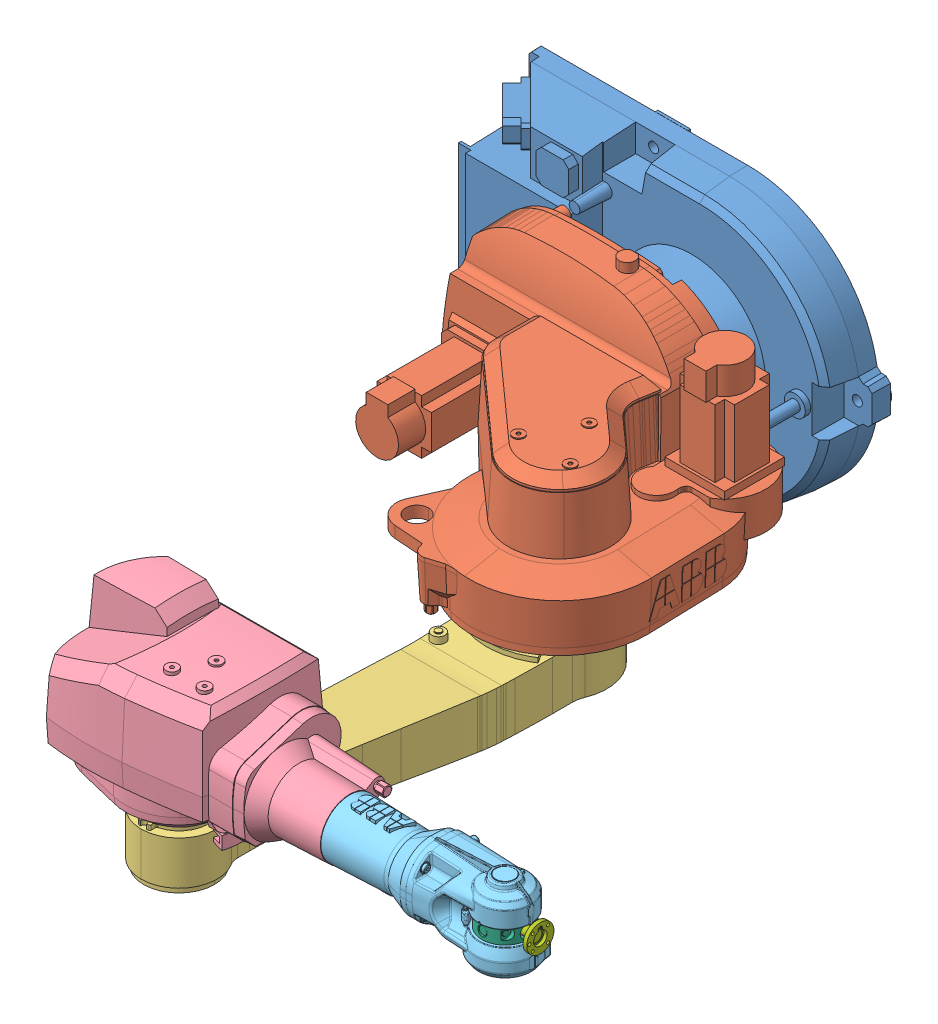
SolidWorks assembly IRB1600_X-145.SLDASM, configuration Default (file format 13000). Lengths in mm.
Overall size (1197.36 510.23 1294.47).
7 component instances, 7 part files, 0 mates.
Components (placement in the parent):
- IRB1600_X-145_IRC5_rev2_BASE-1: IRB1600_X-145_IRC5_rev2_BASE.SLDPRT [Default] at origin size (660.28 510.23 171)
- IRB1600_X-145_IRC5_rev2_LINK1-1: IRB1600_X-145_IRC5_rev2_LINK1.SLDPRT [Default] at origin size (601.3 362.57 535.06)
- IRB1600_X-145_IRC5_rev2_LINK2-1: IRB1600_X-145_IRC5_rev2_LINK2.SLDPRT [Default] at origin size (183.98 146.01 866.22)
- IRB1600_X-145_IRC5_rev2_LINK3-1: IRB1600_X-145_IRC5_rev2_LINK3.SLDPRT [Default] at origin size (508.6 281 243.82)
- IRB1600_X-145_IRC5_rev2_LINK4-2: IRB1600_X-145_IRC5_rev2_LINK4.SLDPRT [Default] at origin size (342.65 134.49 112.07)
- IRB1600_X-145_IRC5_rev2_LINK5-1: IRB1600_X-145_IRC5_rev2_LINK5.SLDPRT [Default] at origin size (84.6 49 84.6)
- IRB1600_X-145_IRC5_rev2_LINK6-1: IRB1600_X-145_IRC5_rev2_LINK6.SLDPRT [Default] at origin size (98.08 50 50)
